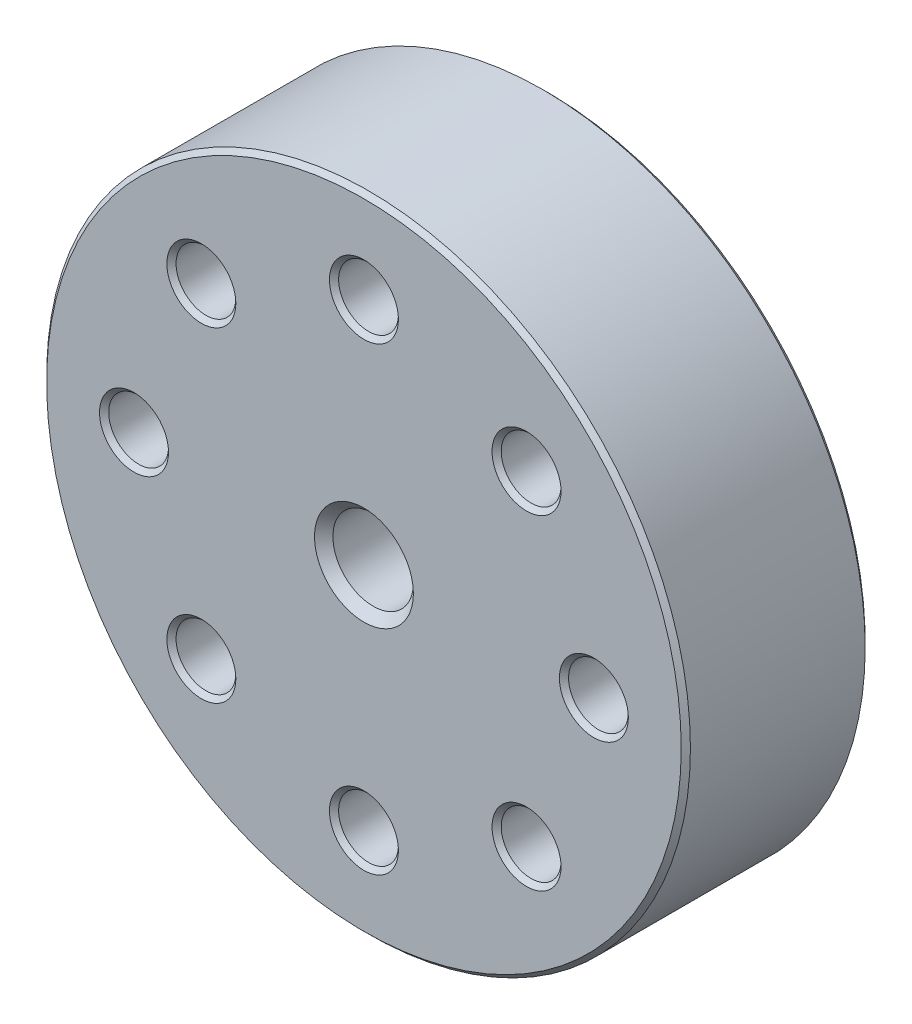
from build123d import *

# Parameters (mm, degrees)
SKETCH_2_R                           = 1.5
CUT_EXTRUDE_1_DEPTH                  = 64.015871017
SKETCH_3_R                           = 4.375
CUT_EXTRUDE_2_DEPTH                  = 16
SKETCH_4_OUTSIDE_W                   = 93.28
SKETCH_4_OUTSIDE_H                   = 93.28
SKETCH_4_OUTSIDE_R                   = 4
CUT_EXTRUDE_3_DEPTH                  = 5
SKETCH_5_R                           = 3.25
CUT_EXTRUDE_4_DEPTH                  = 64.015871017
CHAMFER_1_SIZE                       = 0.5
PATTERN_CIRCULAR_1_COUNT             = 8
CHAMFER_1_OF_PATTERN_CIRCULAR_1_SIZE = 0.5
CHAMFER_2_SIZE                       = 0.5
CHAMFER_3_SIZE                       = 1
SKETCH_7_R                           = 5.500367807
CUT_EXTRUDE_5_DEPTH                  = 5
CHAMFER_4_SIZE                       = 1


with BuildPart() as part:
    # Sketch 1 → Revolve 1 (revolve)
    with BuildSketch(Plane(origin=(0, 0, 0), x_dir=(0, 0, -1), z_dir=(1, 0, 0)), mode=Mode.PRIVATE) as revolve_1_sk:
        Polygon((0, 0), (0, -35), (20, -35), (20, -4.25), (23, -4.25), (23, -5), (39, -5), (39, 0), align=None)
    revolve(revolve_1_sk.sketch.rotate(Axis((0, 0, 115.669329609), (0, 0, -1)), 270), axis=Axis((0, 0, 115.669329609), (0, 0, -1)))

    # Sketch 2 → Cut-Extrude 1 (cut, through all)
    with BuildSketch(Plane(origin=(0, 0, -39), x_dir=(-1, 0, 0), z_dir=(0, 0, -1))):
        Circle(SKETCH_2_R)
    extrude(amount=-CUT_EXTRUDE_1_DEPTH, mode=Mode.SUBTRACT)

    # Sketch 3 → Cut-Extrude 2 (cut)
    with BuildSketch(Plane.XY):
        Circle(SKETCH_3_R)
    extrude(amount=-CUT_EXTRUDE_2_DEPTH, mode=Mode.SUBTRACT)

    # Sketch 4 outside → Cut-Extrude 3 (cut)
    with BuildSketch(Plane(origin=(0, 0, -39), x_dir=(-1, 0, 0), z_dir=(0, 0, -1))):
        Rectangle(SKETCH_4_OUTSIDE_W, SKETCH_4_OUTSIDE_H)
        Circle(SKETCH_4_OUTSIDE_R, mode=Mode.SUBTRACT)
    extrude(amount=-CUT_EXTRUDE_3_DEPTH, mode=Mode.SUBTRACT)

    # Sketch 5 → Cut-Extrude 4 (cut, through all)
    with BuildSketch(Plane.XY):
        with Locations((0, 25)):
            Circle(SKETCH_5_R)
    cut_extrude_4 = extrude(amount=-CUT_EXTRUDE_4_DEPTH, mode=Mode.SUBTRACT)

    # Chamfer 1
    chamfer_1_edges = [part.edges().sort_by_distance(p)[0] for p in [
        (-3.25, 25, -20),
        (-3.25, 25, 0),
    ]]
    chamfer(chamfer_1_edges, length=CHAMFER_1_SIZE)

    # Pattern Circular 1: Cut-Extrude 4 ×8 about axis
    pattern_circular_1_axis = Axis((0, 0, 0), (0, 0, 1))
    for i in range(1, PATTERN_CIRCULAR_1_COUNT):
        add(cut_extrude_4.rotate(pattern_circular_1_axis, i * 360 / PATTERN_CIRCULAR_1_COUNT), mode=Mode.SUBTRACT)

    # Chamfer 1 of Pattern Circular 1
    chamfer_1_of_pattern_circular_1_edges = [part.edges().sort_by_distance(p)[0] for p in [
        (-19.975766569, 15.379572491, -20),
        (-19.975766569, 15.379572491, 0),
        (-25, -3.25, -20),
        (-25, -3.25, 0),
        (-15.379572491, -19.975766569, -20),
        (-15.379572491, -19.975766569, 0),
        (3.25, -25, -20),
        (3.25, -25, 0),
        (19.975766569, -15.379572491, -20),
        (19.975766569, -15.379572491, 0),
        (25, 3.25, -20),
        (25, 3.25, 0),
        (15.379572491, 19.975766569, -20),
        (15.379572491, 19.975766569, 0),
    ]]
    chamfer(chamfer_1_of_pattern_circular_1_edges, length=CHAMFER_1_OF_PATTERN_CIRCULAR_1_SIZE)

    # Chamfer 2
    chamfer_2_edges = [part.edges().sort_by_distance(p)[0] for p in [
        (1.5, 0, -39),
        (4, 0, -39),
        (-35, 0, 0),
        (-35, 0, -20),
        (-4.25, 0, -20),
        (-5, 0, -23),
    ]]
    chamfer(chamfer_2_edges, length=CHAMFER_2_SIZE)

    # Chamfer 3
    chamfer_3_edges = [part.edges().sort_by_distance(p)[0] for p in [
        (-4.375, 0, 0),
    ]]
    chamfer(chamfer_3_edges, length=CHAMFER_3_SIZE)

    # Sketch 7 → Cut-Extrude 5 (cut)
    with BuildSketch(Plane(origin=(0, 0, -39), x_dir=(-1, 0, 0), z_dir=(0, 0, -1))):
        Circle(SKETCH_7_R)
    extrude(amount=-CUT_EXTRUDE_5_DEPTH, mode=Mode.SUBTRACT)

    # Chamfer 4
    chamfer_4_edges = [part.edges().sort_by_distance(p)[0] for p in [
        (-5, 0, -34),
    ]]
    chamfer(chamfer_4_edges, length=CHAMFER_4_SIZE)


solid = part.part
